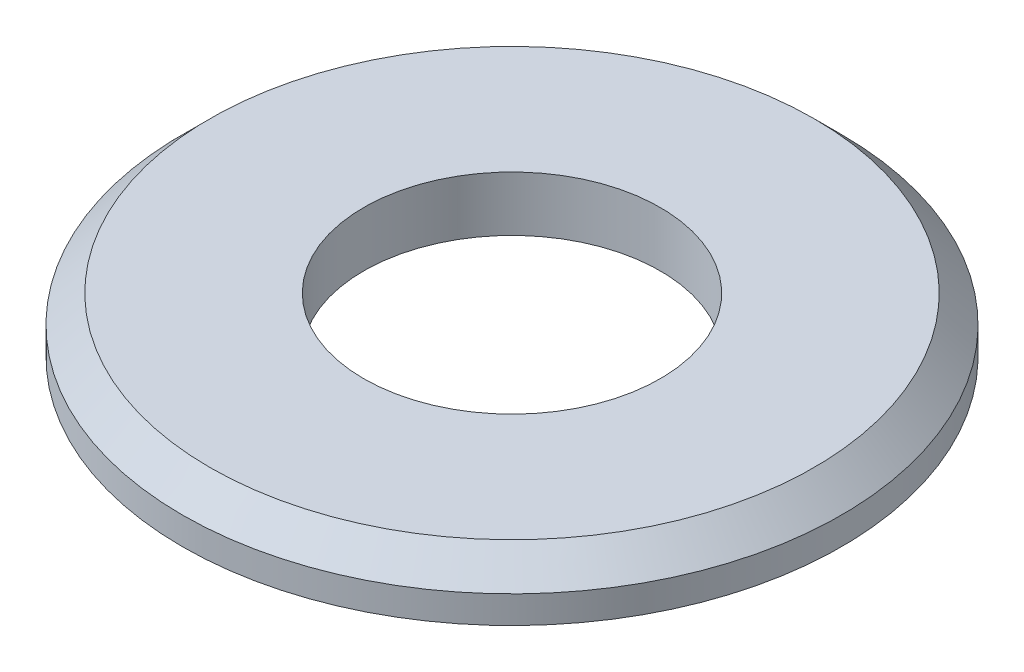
ISO-10303-21;
HEADER;
FILE_DESCRIPTION(('STEP AP214'),'2;1');
FILE_NAME('part.step','',(''),(''),'','','');
FILE_SCHEMA(('AUTOMOTIVE_DESIGN { 1 0 10303 214 1 1 1 1 }'));
ENDSEC;
DATA;
#1=APPLICATION_CONTEXT('core data for automotive mechanical design processes');
#2=APPLICATION_PROTOCOL_DEFINITION('international standard','automotive_design',2000,#1);
#3=PRODUCT_CONTEXT('',#1,'mechanical');
#4=PRODUCT('Part','Part','',(#3));
#5=PRODUCT_RELATED_PRODUCT_CATEGORY('part','',(#4));
#6=PRODUCT_DEFINITION_FORMATION('','',#4);
#7=PRODUCT_DEFINITION_CONTEXT('part definition',#1,'design');
#8=PRODUCT_DEFINITION('design','',#6,#7);
#9=PRODUCT_DEFINITION_SHAPE('','',#8);
#10=(LENGTH_UNIT() NAMED_UNIT(*) SI_UNIT(.MILLI.,.METRE.));
#11=(NAMED_UNIT(*) PLANE_ANGLE_UNIT() SI_UNIT($,.RADIAN.));
#12=(NAMED_UNIT(*) SI_UNIT($,.STERADIAN.) SOLID_ANGLE_UNIT());
#13=UNCERTAINTY_MEASURE_WITH_UNIT(LENGTH_MEASURE(1.E-05),#10,'distance_accuracy_value','');
#14=(GEOMETRIC_REPRESENTATION_CONTEXT(3) GLOBAL_UNCERTAINTY_ASSIGNED_CONTEXT((#13)) GLOBAL_UNIT_ASSIGNED_CONTEXT((#10,
#11,#12)) REPRESENTATION_CONTEXT('',''));
#15=CARTESIAN_POINT('',(0.,0.,0.));
#16=DIRECTION('',(0.,0.,1.));
#17=DIRECTION('',(1.,0.,0.));
#18=AXIS2_PLACEMENT_3D('',#15,#16,#17);
#19=CARTESIAN_POINT('',(0.,0.5,0.));
#20=DIRECTION('',(0.,1.,0.));
#21=DIRECTION('',(0.,0.,1.));
#22=AXIS2_PLACEMENT_3D('',#19,#20,#21);
#23=PLANE('',#22);
#24=CARTESIAN_POINT('',(0.,0.5,0.));
#25=DIRECTION('',(0.,1.,0.));
#26=DIRECTION('',(0.,0.,1.));
#27=AXIS2_PLACEMENT_3D('',#24,#25,#26);
#28=CIRCLE('',#27,2.75);
#29=CARTESIAN_POINT('',(0.,0.5,2.75));
#30=VERTEX_POINT('',#29);
#31=EDGE_CURVE('E35',#30,#30,#28,.T.);
#32=ORIENTED_EDGE('',*,*,#31,.T.);
#33=EDGE_LOOP('',(#32));
#34=FACE_BOUND('',#33,.T.);
#35=CARTESIAN_POINT('',(0.,0.5,0.));
#36=DIRECTION('',(0.,1.,0.));
#37=DIRECTION('',(0.,0.,1.));
#38=AXIS2_PLACEMENT_3D('',#35,#36,#37);
#39=CIRCLE('',#38,1.35);
#40=CARTESIAN_POINT('',(0.,0.5,1.35));
#41=VERTEX_POINT('',#40);
#42=EDGE_CURVE('E43',#41,#41,#39,.T.);
#43=ORIENTED_EDGE('',*,*,#42,.F.);
#44=EDGE_LOOP('',(#43));
#45=FACE_BOUND('',#44,.T.);
#46=ADVANCED_FACE('F28',(#34,#45),#23,.T.);
#47=CARTESIAN_POINT('',(0.,0.,0.));
#48=DIRECTION('',(0.,1.,0.));
#49=DIRECTION('',(0.,0.,1.));
#50=AXIS2_PLACEMENT_3D('',#47,#48,#49);
#51=PLANE('',#50);
#52=CARTESIAN_POINT('',(0.,0.,0.));
#53=DIRECTION('',(0.,1.,0.));
#54=DIRECTION('',(0.,0.,1.));
#55=AXIS2_PLACEMENT_3D('',#52,#53,#54);
#56=CIRCLE('',#55,3.);
#57=CARTESIAN_POINT('',(0.,0.,3.));
#58=VERTEX_POINT('',#57);
#59=EDGE_CURVE('E39',#58,#58,#56,.T.);
#60=ORIENTED_EDGE('',*,*,#59,.F.);
#61=EDGE_LOOP('',(#60));
#62=FACE_BOUND('',#61,.T.);
#63=CARTESIAN_POINT('',(0.,0.,0.));
#64=DIRECTION('',(0.,1.,0.));
#65=DIRECTION('',(0.,0.,1.));
#66=AXIS2_PLACEMENT_3D('',#63,#64,#65);
#67=CIRCLE('',#66,1.35);
#68=CARTESIAN_POINT('',(0.,0.,1.35));
#69=VERTEX_POINT('',#68);
#70=EDGE_CURVE('E48',#69,#69,#67,.T.);
#71=ORIENTED_EDGE('',*,*,#70,.T.);
#72=EDGE_LOOP('',(#71));
#73=FACE_BOUND('',#72,.T.);
#74=ADVANCED_FACE('F52',(#62,#73),#51,.F.);
#75=CARTESIAN_POINT('',(0.,0.5,0.));
#76=DIRECTION('',(0.,-1.,0.));
#77=DIRECTION('',(0.,0.,-1.));
#78=AXIS2_PLACEMENT_3D('',#75,#76,#77);
#79=CYLINDRICAL_SURFACE('',#78,3.);
#80=CARTESIAN_POINT('',(0.,0.25,0.));
#81=DIRECTION('',(0.,1.,0.));
#82=DIRECTION('',(0.,0.,1.));
#83=AXIS2_PLACEMENT_3D('',#80,#81,#82);
#84=CIRCLE('',#83,3.);
#85=CARTESIAN_POINT('',(0.,0.25,3.));
#86=VERTEX_POINT('',#85);
#87=EDGE_CURVE('E10',#86,#86,#84,.F.);
#88=ORIENTED_EDGE('',*,*,#87,.T.);
#89=EDGE_LOOP('',(#88));
#90=FACE_BOUND('',#89,.T.);
#91=ORIENTED_EDGE('',*,*,#59,.T.);
#92=EDGE_LOOP('',(#91));
#93=FACE_BOUND('',#92,.T.);
#94=ADVANCED_FACE('F30',(#90,#93),#79,.T.);
#95=CARTESIAN_POINT('',(0.,0.5,0.));
#96=DIRECTION('',(0.,-1.,0.));
#97=DIRECTION('',(0.,0.,-1.));
#98=AXIS2_PLACEMENT_3D('',#95,#96,#97);
#99=CYLINDRICAL_SURFACE('',#98,1.35);
#100=ORIENTED_EDGE('',*,*,#42,.T.);
#101=EDGE_LOOP('',(#100));
#102=FACE_BOUND('',#101,.T.);
#103=ORIENTED_EDGE('',*,*,#70,.F.);
#104=EDGE_LOOP('',(#103));
#105=FACE_BOUND('',#104,.T.);
#106=ADVANCED_FACE('F54',(#102,#105),#99,.F.);
#107=CARTESIAN_POINT('',(0.,0.5,0.));
#108=DIRECTION('',(0.,-1.,0.));
#109=DIRECTION('',(0.,0.,-1.));
#110=AXIS2_PLACEMENT_3D('',#107,#108,#109);
#111=CONICAL_SURFACE('',#110,2.75,0.785398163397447);
#112=ORIENTED_EDGE('',*,*,#87,.F.);
#113=EDGE_LOOP('',(#112));
#114=FACE_BOUND('',#113,.T.);
#115=ORIENTED_EDGE('',*,*,#31,.F.);
#116=EDGE_LOOP('',(#115));
#117=FACE_BOUND('',#116,.T.);
#118=ADVANCED_FACE('F56',(#114,#117),#111,.T.);
#119=CLOSED_SHELL('',(#46,#74,#94,#106,#118));
#120=MANIFOLD_SOLID_BREP('B2',#119);
#121=ADVANCED_BREP_SHAPE_REPRESENTATION('',(#18,#120),#14);
#122=SHAPE_DEFINITION_REPRESENTATION(#9,#121);
ENDSEC;
END-ISO-10303-21;
